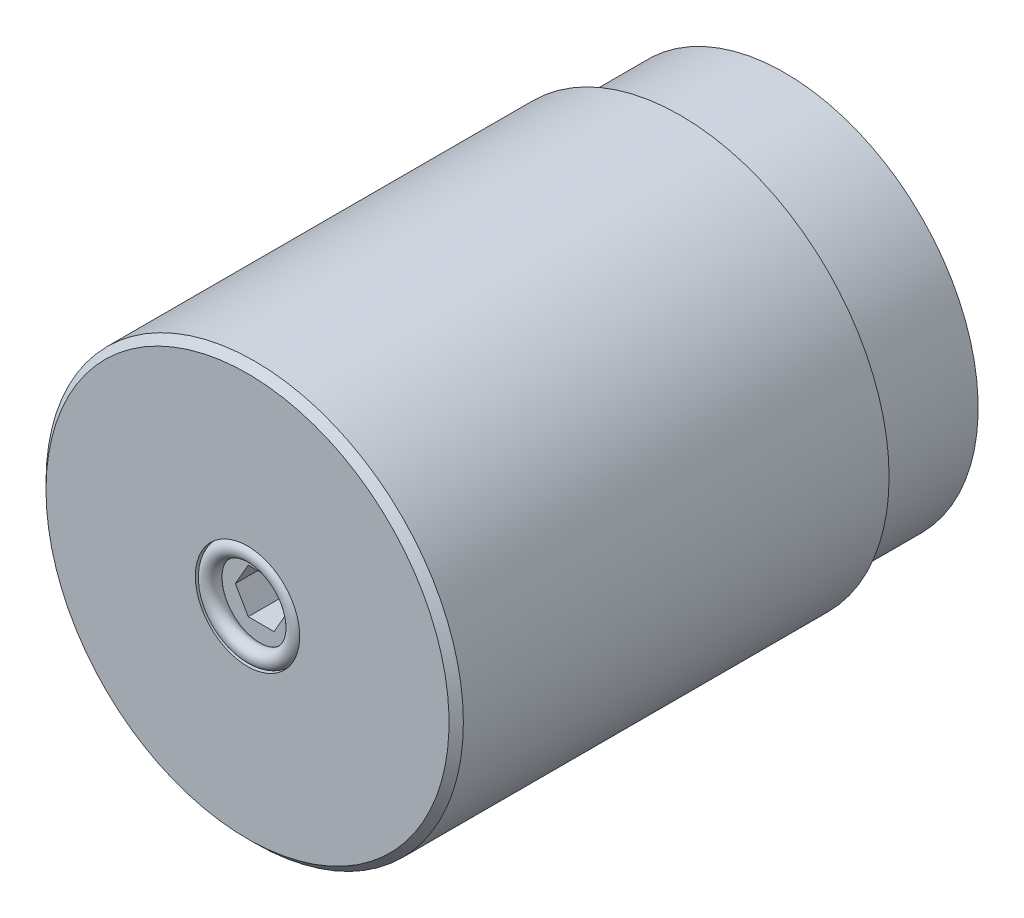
ISO-10303-21;
HEADER;
FILE_DESCRIPTION(('STEP AP214'),'2;1');
FILE_NAME('part.step','',(''),(''),'','','');
FILE_SCHEMA(('AUTOMOTIVE_DESIGN { 1 0 10303 214 1 1 1 1 }'));
ENDSEC;
DATA;
#1=APPLICATION_CONTEXT('core data for automotive mechanical design processes');
#2=APPLICATION_PROTOCOL_DEFINITION('international standard','automotive_design',2000,#1);
#3=PRODUCT_CONTEXT('',#1,'mechanical');
#4=PRODUCT('Part','Part','',(#3));
#5=PRODUCT_RELATED_PRODUCT_CATEGORY('part','',(#4));
#6=PRODUCT_DEFINITION_FORMATION('','',#4);
#7=PRODUCT_DEFINITION_CONTEXT('part definition',#1,'design');
#8=PRODUCT_DEFINITION('design','',#6,#7);
#9=PRODUCT_DEFINITION_SHAPE('','',#8);
#10=(LENGTH_UNIT() NAMED_UNIT(*) SI_UNIT(.MILLI.,.METRE.));
#11=(NAMED_UNIT(*) PLANE_ANGLE_UNIT() SI_UNIT($,.RADIAN.));
#12=(NAMED_UNIT(*) SI_UNIT($,.STERADIAN.) SOLID_ANGLE_UNIT());
#13=UNCERTAINTY_MEASURE_WITH_UNIT(LENGTH_MEASURE(1.E-05),#10,'distance_accuracy_value','');
#14=(GEOMETRIC_REPRESENTATION_CONTEXT(3) GLOBAL_UNCERTAINTY_ASSIGNED_CONTEXT((#13)) GLOBAL_UNIT_ASSIGNED_CONTEXT((#10,
#11,#12)) REPRESENTATION_CONTEXT('',''));
#15=CARTESIAN_POINT('',(0.,0.,0.));
#16=DIRECTION('',(0.,0.,1.));
#17=DIRECTION('',(1.,0.,0.));
#18=AXIS2_PLACEMENT_3D('',#15,#16,#17);
#19=CARTESIAN_POINT('',(0.,0.,-1.4478));
#20=DIRECTION('',(0.,0.,1.));
#21=DIRECTION('',(1.,0.,0.));
#22=AXIS2_PLACEMENT_3D('',#19,#20,#21);
#23=PLANE('',#22);
#24=CARTESIAN_POINT('',(0.,0.,-1.4478));
#25=DIRECTION('',(0.,0.,-1.));
#26=DIRECTION('',(-1.,0.,0.));
#27=AXIS2_PLACEMENT_3D('',#24,#25,#26);
#28=CIRCLE('',#27,5.5499);
#29=CARTESIAN_POINT('',(-5.5499,0.,-1.4478));
#30=VERTEX_POINT('',#29);
#31=EDGE_CURVE('E153',#30,#30,#28,.T.);
#32=ORIENTED_EDGE('',*,*,#31,.F.);
#33=EDGE_LOOP('',(#32));
#34=FACE_BOUND('',#33,.T.);
#35=CARTESIAN_POINT('',(0.,0.,-1.4478));
#36=DIRECTION('',(0.,0.,1.));
#37=DIRECTION('',(1.,0.,0.));
#38=AXIS2_PLACEMENT_3D('',#35,#36,#37);
#39=CIRCLE('',#38,5.11753501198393);
#40=CARTESIAN_POINT('',(5.11753501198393,0.,-1.4478));
#41=VERTEX_POINT('',#40);
#42=EDGE_CURVE('E215',#41,#41,#39,.T.);
#43=ORIENTED_EDGE('',*,*,#42,.F.);
#44=EDGE_LOOP('',(#43));
#45=FACE_BOUND('',#44,.T.);
#46=ADVANCED_FACE('F33',(#34,#45),#23,.T.);
#47=CARTESIAN_POINT('',(0.,0.,0.));
#48=DIRECTION('',(0.,0.,-1.));
#49=DIRECTION('',(-1.,0.,0.));
#50=AXIS2_PLACEMENT_3D('',#47,#48,#49);
#51=CYLINDRICAL_SURFACE('',#50,5.5499);
#52=ORIENTED_EDGE('',*,*,#31,.T.);
#53=EDGE_LOOP('',(#52));
#54=FACE_BOUND('',#53,.T.);
#55=CARTESIAN_POINT('',(0.,0.,0.));
#56=DIRECTION('',(0.,0.,-1.));
#57=DIRECTION('',(-1.,0.,0.));
#58=AXIS2_PLACEMENT_3D('',#55,#56,#57);
#59=CIRCLE('',#58,5.5499);
#60=CARTESIAN_POINT('',(-5.5499,0.,0.));
#61=VERTEX_POINT('',#60);
#62=EDGE_CURVE('E150',#61,#61,#59,.T.);
#63=ORIENTED_EDGE('',*,*,#62,.F.);
#64=EDGE_LOOP('',(#63));
#65=FACE_BOUND('',#64,.T.);
#66=ADVANCED_FACE('F184',(#54,#65),#51,.F.);
#67=CARTESIAN_POINT('',(0.,5.5499,0.));
#68=DIRECTION('',(0.,0.,1.));
#69=DIRECTION('',(1.,0.,0.));
#70=AXIS2_PLACEMENT_3D('',#67,#68,#69);
#71=PLANE('',#70);
#72=CARTESIAN_POINT('',(0.,0.,0.));
#73=DIRECTION('',(0.,0.,1.));
#74=DIRECTION('',(1.,0.,0.));
#75=AXIS2_PLACEMENT_3D('',#72,#73,#74);
#76=CIRCLE('',#75,21.4376);
#77=CARTESIAN_POINT('',(-21.4376,0.,0.));
#78=VERTEX_POINT('',#77);
#79=EDGE_CURVE('E165',#78,#78,#76,.T.);
#80=ORIENTED_EDGE('',*,*,#79,.T.);
#81=EDGE_LOOP('',(#80));
#82=FACE_BOUND('',#81,.T.);
#83=ORIENTED_EDGE('',*,*,#62,.T.);
#84=EDGE_LOOP('',(#83));
#85=FACE_BOUND('',#84,.T.);
#86=ADVANCED_FACE('F191',(#82,#85),#71,.T.);
#87=CARTESIAN_POINT('',(0.,0.,0.));
#88=DIRECTION('',(0.,0.,-1.));
#89=DIRECTION('',(-1.,0.,0.));
#90=AXIS2_PLACEMENT_3D('',#87,#88,#89);
#91=CYLINDRICAL_SURFACE('',#90,22.1996);
#92=CARTESIAN_POINT('',(0.,0.,-0.761999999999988));
#93=DIRECTION('',(0.,0.,1.));
#94=DIRECTION('',(1.,0.,0.));
#95=AXIS2_PLACEMENT_3D('',#92,#93,#94);
#96=CIRCLE('',#95,22.1996);
#97=CARTESIAN_POINT('',(-22.1996,0.,-0.761999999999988));
#98=VERTEX_POINT('',#97);
#99=EDGE_CURVE('E162',#98,#98,#96,.F.);
#100=ORIENTED_EDGE('',*,*,#99,.T.);
#101=EDGE_LOOP('',(#100));
#102=FACE_BOUND('',#101,.T.);
#103=CARTESIAN_POINT('',(0.,0.,-46.0502));
#104=DIRECTION('',(0.,0.,-1.));
#105=DIRECTION('',(-1.,0.,0.));
#106=AXIS2_PLACEMENT_3D('',#103,#104,#105);
#107=CIRCLE('',#106,22.1996);
#108=CARTESIAN_POINT('',(-22.1996,0.,-46.0502));
#109=VERTEX_POINT('',#108);
#110=EDGE_CURVE('E147',#109,#109,#107,.T.);
#111=ORIENTED_EDGE('',*,*,#110,.F.);
#112=EDGE_LOOP('',(#111));
#113=FACE_BOUND('',#112,.T.);
#114=ADVANCED_FACE('F254',(#102,#113),#91,.T.);
#115=CARTESIAN_POINT('',(0.,22.1996,-46.0502));
#116=DIRECTION('',(0.,0.,-1.));
#117=DIRECTION('',(-1.,0.,0.));
#118=AXIS2_PLACEMENT_3D('',#115,#116,#117);
#119=PLANE('',#118);
#120=CARTESIAN_POINT('',(0.,0.,-46.0502));
#121=DIRECTION('',(0.,0.,-1.));
#122=DIRECTION('',(-1.,0.,0.));
#123=AXIS2_PLACEMENT_3D('',#120,#121,#122);
#124=CIRCLE('',#123,20.955);
#125=CARTESIAN_POINT('',(-20.955,0.,-46.0502));
#126=VERTEX_POINT('',#125);
#127=EDGE_CURVE('E159',#126,#126,#124,.F.);
#128=ORIENTED_EDGE('',*,*,#127,.T.);
#129=EDGE_LOOP('',(#128));
#130=FACE_BOUND('',#129,.T.);
#131=ORIENTED_EDGE('',*,*,#110,.T.);
#132=EDGE_LOOP('',(#131));
#133=FACE_BOUND('',#132,.T.);
#134=ADVANCED_FACE('F250',(#130,#133),#119,.T.);
#135=CARTESIAN_POINT('',(0.,0.,0.));
#136=DIRECTION('',(0.,0.,-1.));
#137=DIRECTION('',(-1.,0.,0.));
#138=AXIS2_PLACEMENT_3D('',#135,#136,#137);
#139=CYLINDRICAL_SURFACE('',#138,20.574);
#140=CARTESIAN_POINT('',(0.,0.,-46.4312));
#141=DIRECTION('',(0.,0.,-1.));
#142=DIRECTION('',(-1.,0.,0.));
#143=AXIS2_PLACEMENT_3D('',#140,#141,#142);
#144=CIRCLE('',#143,20.574);
#145=CARTESIAN_POINT('',(-20.574,0.,-46.4312));
#146=VERTEX_POINT('',#145);
#147=EDGE_CURVE('E156',#146,#146,#144,.T.);
#148=ORIENTED_EDGE('',*,*,#147,.T.);
#149=EDGE_LOOP('',(#148));
#150=FACE_BOUND('',#149,.T.);
#151=CARTESIAN_POINT('',(0.,0.,-57.15));
#152=DIRECTION('',(0.,0.,-1.));
#153=DIRECTION('',(-1.,0.,0.));
#154=AXIS2_PLACEMENT_3D('',#151,#152,#153);
#155=CIRCLE('',#154,20.574);
#156=CARTESIAN_POINT('',(-20.574,0.,-57.15));
#157=VERTEX_POINT('',#156);
#158=EDGE_CURVE('E139',#157,#157,#155,.T.);
#159=ORIENTED_EDGE('',*,*,#158,.F.);
#160=EDGE_LOOP('',(#159));
#161=FACE_BOUND('',#160,.T.);
#162=ADVANCED_FACE('F246',(#150,#161),#139,.T.);
#163=CARTESIAN_POINT('',(0.,20.574,-57.15));
#164=DIRECTION('',(0.,0.,-1.));
#165=DIRECTION('',(-1.,0.,0.));
#166=AXIS2_PLACEMENT_3D('',#163,#164,#165);
#167=PLANE('',#166);
#168=CARTESIAN_POINT('',(0.,4.445,-57.15));
#169=DIRECTION('',(0.,0.,-1.));
#170=DIRECTION('',(-1.,0.,0.));
#171=AXIS2_PLACEMENT_3D('',#168,#169,#170);
#172=CIRCLE('',#171,9.8552);
#173=CARTESIAN_POINT('',(-9.8552,4.445,-57.15));
#174=VERTEX_POINT('',#173);
#175=EDGE_CURVE('E11',#174,#174,#172,.F.);
#176=ORIENTED_EDGE('',*,*,#175,.T.);
#177=EDGE_LOOP('',(#176));
#178=FACE_BOUND('',#177,.T.);
#179=CARTESIAN_POINT('',(-15.875,1.12806160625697E-13,-57.15));
#180=DIRECTION('',(0.,0.,-1.));
#181=DIRECTION('',(-1.,0.,0.));
#182=AXIS2_PLACEMENT_3D('',#179,#180,#181);
#183=CIRCLE('',#182,1.5875);
#184=CARTESIAN_POINT('',(-17.4625,1.12806160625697E-13,-57.15));
#185=VERTEX_POINT('',#184);
#186=EDGE_CURVE('E493',#185,#185,#183,.T.);
#187=ORIENTED_EDGE('',*,*,#186,.F.);
#188=EDGE_LOOP('',(#187));
#189=FACE_BOUND('',#188,.T.);
#190=CARTESIAN_POINT('',(-7.93750000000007,-13.7481532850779,-57.15));
#191=DIRECTION('',(0.,0.,-1.));
#192=DIRECTION('',(-1.,0.,0.));
#193=AXIS2_PLACEMENT_3D('',#190,#191,#192);
#194=CIRCLE('',#193,1.5875);
#195=CARTESIAN_POINT('',(-9.52500000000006,-13.7481532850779,-57.15));
#196=VERTEX_POINT('',#195);
#197=EDGE_CURVE('E502',#196,#196,#194,.T.);
#198=ORIENTED_EDGE('',*,*,#197,.F.);
#199=EDGE_LOOP('',(#198));
#200=FACE_BOUND('',#199,.T.);
#201=CARTESIAN_POINT('',(7.93749999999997,-13.748153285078,-57.15));
#202=DIRECTION('',(0.,0.,-1.));
#203=DIRECTION('',(-1.,0.,0.));
#204=AXIS2_PLACEMENT_3D('',#201,#202,#203);
#205=CIRCLE('',#204,1.5875);
#206=CARTESIAN_POINT('',(6.34999999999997,-13.748153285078,-57.15));
#207=VERTEX_POINT('',#206);
#208=EDGE_CURVE('E508',#207,#207,#205,.T.);
#209=ORIENTED_EDGE('',*,*,#208,.F.);
#210=EDGE_LOOP('',(#209));
#211=FACE_BOUND('',#210,.T.);
#212=CARTESIAN_POINT('',(15.875,0.,-57.15));
#213=DIRECTION('',(0.,0.,-1.));
#214=DIRECTION('',(-1.,0.,0.));
#215=AXIS2_PLACEMENT_3D('',#212,#213,#214);
#216=CIRCLE('',#215,1.5875);
#217=CARTESIAN_POINT('',(14.2875,0.,-57.15));
#218=VERTEX_POINT('',#217);
#219=EDGE_CURVE('E218',#218,#218,#216,.T.);
#220=ORIENTED_EDGE('',*,*,#219,.F.);
#221=EDGE_LOOP('',(#220));
#222=FACE_BOUND('',#221,.T.);
#223=ORIENTED_EDGE('',*,*,#158,.T.);
#224=EDGE_LOOP('',(#223));
#225=FACE_BOUND('',#224,.T.);
#226=ADVANCED_FACE('F242',(#178,#189,#200,#211,#222,#225),#167,.T.);
#227=CARTESIAN_POINT('',(0.,0.,-46.4312));
#228=DIRECTION('',(0.,0.,-1.));
#229=DIRECTION('',(-1.,0.,0.));
#230=AXIS2_PLACEMENT_3D('',#227,#228,#229);
#231=TOROIDAL_SURFACE('',#230,20.955,0.381);
#232=ORIENTED_EDGE('',*,*,#127,.F.);
#233=EDGE_LOOP('',(#232));
#234=FACE_BOUND('',#233,.T.);
#235=ORIENTED_EDGE('',*,*,#147,.F.);
#236=EDGE_LOOP('',(#235));
#237=FACE_BOUND('',#236,.T.);
#238=ADVANCED_FACE('F245',(#234,#237),#231,.F.);
#239=CARTESIAN_POINT('',(0.,0.,-0.6858));
#240=DIRECTION('',(0.,0.,1.));
#241=DIRECTION('',(1.,0.,0.));
#242=AXIS2_PLACEMENT_3D('',#239,#240,#241);
#243=TOROIDAL_SURFACE('',#242,4.65963,0.889);
#244=CARTESIAN_POINT('',(0.,0.,-1.4478));
#245=DIRECTION('',(0.,0.,1.));
#246=DIRECTION('',(1.,0.,0.));
#247=AXIS2_PLACEMENT_3D('',#244,#245,#246);
#248=CIRCLE('',#247,4.20172498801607);
#249=CARTESIAN_POINT('',(4.20172498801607,0.,-1.4478));
#250=VERTEX_POINT('',#249);
#251=EDGE_CURVE('E126',#250,#250,#248,.T.);
#252=ORIENTED_EDGE('',*,*,#251,.F.);
#253=EDGE_LOOP('',(#252));
#254=FACE_BOUND('',#253,.T.);
#255=ORIENTED_EDGE('',*,*,#42,.T.);
#256=EDGE_LOOP('',(#255));
#257=FACE_BOUND('',#256,.T.);
#258=ADVANCED_FACE('F299',(#254,#257),#243,.T.);
#259=CARTESIAN_POINT('',(4.11344746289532,2.3749,-8.382));
#260=DIRECTION('',(0.,0.,1.));
#261=DIRECTION('',(1.,0.,0.));
#262=AXIS2_PLACEMENT_3D('',#259,#260,#261);
#263=PLANE('',#262);
#264=DIRECTION('',(0.5,0.866025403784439,0.));
#265=VECTOR('',#264,1.);
#266=CARTESIAN_POINT('',(1.37114915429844,-2.3749,-8.382));
#267=LINE('',#266,#265);
#268=CARTESIAN_POINT('',(1.37114915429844,-2.3749,-8.382));
#269=VERTEX_POINT('',#268);
#270=CARTESIAN_POINT('',(2.74229830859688,0.,-8.382));
#271=VERTEX_POINT('',#270);
#272=EDGE_CURVE('E137',#269,#271,#267,.T.);
#273=ORIENTED_EDGE('',*,*,#272,.T.);
#274=DIRECTION('',(-0.5,0.866025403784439,0.));
#275=VECTOR('',#274,1.);
#276=CARTESIAN_POINT('',(2.74229830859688,0.,-8.382));
#277=LINE('',#276,#275);
#278=CARTESIAN_POINT('',(1.37114915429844,2.3749,-8.382));
#279=VERTEX_POINT('',#278);
#280=EDGE_CURVE('E119',#271,#279,#277,.T.);
#281=ORIENTED_EDGE('',*,*,#280,.T.);
#282=DIRECTION('',(-1.,0.,0.));
#283=VECTOR('',#282,1.);
#284=CARTESIAN_POINT('',(1.37114915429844,2.3749,-8.382));
#285=LINE('',#284,#283);
#286=CARTESIAN_POINT('',(-1.37114915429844,2.3749,-8.382));
#287=VERTEX_POINT('',#286);
#288=EDGE_CURVE('E117',#279,#287,#285,.T.);
#289=ORIENTED_EDGE('',*,*,#288,.T.);
#290=DIRECTION('',(-0.5,-0.866025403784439,0.));
#291=VECTOR('',#290,1.);
#292=CARTESIAN_POINT('',(-1.37114915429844,2.3749,-8.382));
#293=LINE('',#292,#291);
#294=CARTESIAN_POINT('',(-2.74229830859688,0.,-8.382));
#295=VERTEX_POINT('',#294);
#296=EDGE_CURVE('E96',#287,#295,#293,.T.);
#297=ORIENTED_EDGE('',*,*,#296,.T.);
#298=DIRECTION('',(0.5,-0.866025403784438,0.));
#299=VECTOR('',#298,1.);
#300=CARTESIAN_POINT('',(-2.74229830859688,0.,-8.382));
#301=LINE('',#300,#299);
#302=CARTESIAN_POINT('',(-1.37114915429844,-2.3749,-8.382));
#303=VERTEX_POINT('',#302);
#304=EDGE_CURVE('E107',#295,#303,#301,.T.);
#305=ORIENTED_EDGE('',*,*,#304,.T.);
#306=DIRECTION('',(1.,0.,0.));
#307=VECTOR('',#306,1.);
#308=CARTESIAN_POINT('',(-1.37114915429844,-2.3749,-8.382));
#309=LINE('',#308,#307);
#310=EDGE_CURVE('E111',#303,#269,#309,.T.);
#311=ORIENTED_EDGE('',*,*,#310,.T.);
#312=EDGE_LOOP('',(#273,#281,#289,#297,#305,#311));
#313=FACE_BOUND('',#312,.T.);
#314=ADVANCED_FACE('F114',(#313),#263,.T.);
#315=CARTESIAN_POINT('',(2.74229830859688,0.,-8.382));
#316=DIRECTION('',(0.866025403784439,0.5,0.));
#317=DIRECTION('',(-0.5,0.866025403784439,0.));
#318=AXIS2_PLACEMENT_3D('',#315,#316,#317);
#319=PLANE('',#318);
#320=DIRECTION('',(-0.5,0.866025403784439,0.));
#321=VECTOR('',#320,1.);
#322=CARTESIAN_POINT('',(2.74229830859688,0.,-1.4478));
#323=LINE('',#322,#321);
#324=CARTESIAN_POINT('',(2.74229830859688,0.,-1.4478));
#325=VERTEX_POINT('',#324);
#326=CARTESIAN_POINT('',(1.37114915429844,2.3749,-1.4478));
#327=VERTEX_POINT('',#326);
#328=EDGE_CURVE('E125',#325,#327,#323,.T.);
#329=ORIENTED_EDGE('',*,*,#328,.T.);
#330=DIRECTION('',(0.,0.,1.));
#331=VECTOR('',#330,1.);
#332=CARTESIAN_POINT('',(1.37114915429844,2.3749,-8.382));
#333=LINE('',#332,#331);
#334=EDGE_CURVE('E142',#279,#327,#333,.T.);
#335=ORIENTED_EDGE('',*,*,#334,.F.);
#336=ORIENTED_EDGE('',*,*,#280,.F.);
#337=DIRECTION('',(0.,0.,1.));
#338=VECTOR('',#337,1.);
#339=CARTESIAN_POINT('',(2.74229830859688,0.,-8.382));
#340=LINE('',#339,#338);
#341=EDGE_CURVE('E79',#271,#325,#340,.T.);
#342=ORIENTED_EDGE('',*,*,#341,.T.);
#343=EDGE_LOOP('',(#329,#335,#336,#342));
#344=FACE_BOUND('',#343,.T.);
#345=ADVANCED_FACE('F223',(#344),#319,.F.);
#346=CARTESIAN_POINT('',(1.37114915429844,2.3749,-8.382));
#347=DIRECTION('',(0.,1.,0.));
#348=DIRECTION('',(-1.,0.,0.));
#349=AXIS2_PLACEMENT_3D('',#346,#347,#348);
#350=PLANE('',#349);
#351=DIRECTION('',(-1.,0.,0.));
#352=VECTOR('',#351,1.);
#353=CARTESIAN_POINT('',(1.37114915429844,2.3749,-1.4478));
#354=LINE('',#353,#352);
#355=CARTESIAN_POINT('',(-1.37114915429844,2.3749,-1.4478));
#356=VERTEX_POINT('',#355);
#357=EDGE_CURVE('E129',#327,#356,#354,.T.);
#358=ORIENTED_EDGE('',*,*,#357,.T.);
#359=DIRECTION('',(0.,0.,1.));
#360=VECTOR('',#359,1.);
#361=CARTESIAN_POINT('',(-1.37114915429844,2.3749,-8.382));
#362=LINE('',#361,#360);
#363=EDGE_CURVE('E104',#287,#356,#362,.T.);
#364=ORIENTED_EDGE('',*,*,#363,.F.);
#365=ORIENTED_EDGE('',*,*,#288,.F.);
#366=ORIENTED_EDGE('',*,*,#334,.T.);
#367=EDGE_LOOP('',(#358,#364,#365,#366));
#368=FACE_BOUND('',#367,.T.);
#369=ADVANCED_FACE('F226',(#368),#350,.F.);
#370=CARTESIAN_POINT('',(-1.37114915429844,2.3749,-8.382));
#371=DIRECTION('',(-0.866025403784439,0.5,0.));
#372=DIRECTION('',(-0.5,-0.866025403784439,0.));
#373=AXIS2_PLACEMENT_3D('',#370,#371,#372);
#374=PLANE('',#373);
#375=DIRECTION('',(-0.5,-0.866025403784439,0.));
#376=VECTOR('',#375,1.);
#377=CARTESIAN_POINT('',(-1.37114915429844,2.3749,-1.4478));
#378=LINE('',#377,#376);
#379=CARTESIAN_POINT('',(-2.74229830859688,0.,-1.4478));
#380=VERTEX_POINT('',#379);
#381=EDGE_CURVE('E99',#356,#380,#378,.T.);
#382=ORIENTED_EDGE('',*,*,#381,.T.);
#383=DIRECTION('',(0.,0.,1.));
#384=VECTOR('',#383,1.);
#385=CARTESIAN_POINT('',(-2.74229830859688,0.,-8.382));
#386=LINE('',#385,#384);
#387=EDGE_CURVE('E92',#295,#380,#386,.T.);
#388=ORIENTED_EDGE('',*,*,#387,.F.);
#389=ORIENTED_EDGE('',*,*,#296,.F.);
#390=ORIENTED_EDGE('',*,*,#363,.T.);
#391=EDGE_LOOP('',(#382,#388,#389,#390));
#392=FACE_BOUND('',#391,.T.);
#393=ADVANCED_FACE('F94',(#392),#374,.F.);
#394=CARTESIAN_POINT('',(-2.74229830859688,0.,-8.382));
#395=DIRECTION('',(-0.866025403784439,-0.5,0.));
#396=DIRECTION('',(0.5,-0.866025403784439,0.));
#397=AXIS2_PLACEMENT_3D('',#394,#395,#396);
#398=PLANE('',#397);
#399=DIRECTION('',(0.5,-0.866025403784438,0.));
#400=VECTOR('',#399,1.);
#401=CARTESIAN_POINT('',(-2.74229830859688,0.,-1.4478));
#402=LINE('',#401,#400);
#403=CARTESIAN_POINT('',(-1.37114915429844,-2.3749,-1.4478));
#404=VERTEX_POINT('',#403);
#405=EDGE_CURVE('E133',#380,#404,#402,.T.);
#406=ORIENTED_EDGE('',*,*,#405,.T.);
#407=DIRECTION('',(0.,0.,1.));
#408=VECTOR('',#407,1.);
#409=CARTESIAN_POINT('',(-1.37114915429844,-2.3749,-8.382));
#410=LINE('',#409,#408);
#411=EDGE_CURVE('E103',#303,#404,#410,.T.);
#412=ORIENTED_EDGE('',*,*,#411,.F.);
#413=ORIENTED_EDGE('',*,*,#304,.F.);
#414=ORIENTED_EDGE('',*,*,#387,.T.);
#415=EDGE_LOOP('',(#406,#412,#413,#414));
#416=FACE_BOUND('',#415,.T.);
#417=ADVANCED_FACE('F108',(#416),#398,.F.);
#418=CARTESIAN_POINT('',(-1.37114915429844,-2.3749,-8.382));
#419=DIRECTION('',(0.,-1.,0.));
#420=DIRECTION('',(0.,0.,-1.));
#421=AXIS2_PLACEMENT_3D('',#418,#419,#420);
#422=PLANE('',#421);
#423=DIRECTION('',(1.,0.,0.));
#424=VECTOR('',#423,1.);
#425=CARTESIAN_POINT('',(-1.37114915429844,-2.3749,-1.4478));
#426=LINE('',#425,#424);
#427=CARTESIAN_POINT('',(1.37114915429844,-2.3749,-1.4478));
#428=VERTEX_POINT('',#427);
#429=EDGE_CURVE('E135',#404,#428,#426,.T.);
#430=ORIENTED_EDGE('',*,*,#429,.T.);
#431=DIRECTION('',(0.,0.,1.));
#432=VECTOR('',#431,1.);
#433=CARTESIAN_POINT('',(1.37114915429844,-2.3749,-8.382));
#434=LINE('',#433,#432);
#435=EDGE_CURVE('E56',#269,#428,#434,.T.);
#436=ORIENTED_EDGE('',*,*,#435,.F.);
#437=ORIENTED_EDGE('',*,*,#310,.F.);
#438=ORIENTED_EDGE('',*,*,#411,.T.);
#439=EDGE_LOOP('',(#430,#436,#437,#438));
#440=FACE_BOUND('',#439,.T.);
#441=ADVANCED_FACE('F207',(#440),#422,.F.);
#442=CARTESIAN_POINT('',(1.37114915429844,-2.3749,-8.382));
#443=DIRECTION('',(0.866025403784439,-0.5,0.));
#444=DIRECTION('',(0.5,0.866025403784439,0.));
#445=AXIS2_PLACEMENT_3D('',#442,#443,#444);
#446=PLANE('',#445);
#447=DIRECTION('',(0.5,0.866025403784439,0.));
#448=VECTOR('',#447,1.);
#449=CARTESIAN_POINT('',(1.37114915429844,-2.3749,-1.4478));
#450=LINE('',#449,#448);
#451=EDGE_CURVE('E48',#428,#325,#450,.T.);
#452=ORIENTED_EDGE('',*,*,#451,.T.);
#453=ORIENTED_EDGE('',*,*,#341,.F.);
#454=ORIENTED_EDGE('',*,*,#272,.F.);
#455=ORIENTED_EDGE('',*,*,#435,.T.);
#456=EDGE_LOOP('',(#452,#453,#454,#455));
#457=FACE_BOUND('',#456,.T.);
#458=ADVANCED_FACE('F199',(#457),#446,.F.);
#459=ORIENTED_EDGE('',*,*,#451,.F.);
#460=ORIENTED_EDGE('',*,*,#429,.F.);
#461=ORIENTED_EDGE('',*,*,#405,.F.);
#462=ORIENTED_EDGE('',*,*,#381,.F.);
#463=ORIENTED_EDGE('',*,*,#357,.F.);
#464=ORIENTED_EDGE('',*,*,#328,.F.);
#465=EDGE_LOOP('',(#459,#460,#461,#462,#463,#464));
#466=FACE_BOUND('',#465,.T.);
#467=ORIENTED_EDGE('',*,*,#251,.T.);
#468=EDGE_LOOP('',(#467));
#469=FACE_BOUND('',#468,.T.);
#470=ADVANCED_FACE('F187',(#466,#469),#23,.T.);
#471=CARTESIAN_POINT('',(0.,0.,-0.761999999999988));
#472=DIRECTION('',(0.,0.,-1.));
#473=DIRECTION('',(-1.,0.,0.));
#474=AXIS2_PLACEMENT_3D('',#471,#472,#473);
#475=CONICAL_SURFACE('',#474,22.1996,0.785398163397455);
#476=CARTESIAN_POINT('',(-21.4376,0.,0.));
#477=CARTESIAN_POINT('',(-21.4455375,0.,-0.00793749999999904));
#478=CARTESIAN_POINT('',(-21.453475,0.,-0.0158749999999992));
#479=CARTESIAN_POINT('',(-21.46935,0.,-0.0317499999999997));
#480=CARTESIAN_POINT('',(-21.4772875,0.,-0.0396874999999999));
#481=CARTESIAN_POINT('',(-21.4931625,0.,-0.0555624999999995));
#482=CARTESIAN_POINT('',(-21.5011,0.,-0.0634999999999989));
#483=CARTESIAN_POINT('',(-21.516975,0.,-0.0793749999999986));
#484=CARTESIAN_POINT('',(-21.5249125,0.,-0.0873124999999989));
#485=CARTESIAN_POINT('',(-21.5407875,0.,-0.103187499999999));
#486=CARTESIAN_POINT('',(-21.548725,0.,-0.111124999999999));
#487=CARTESIAN_POINT('',(-21.5646,0.,-0.126999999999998));
#488=CARTESIAN_POINT('',(-21.5725375,0.,-0.134937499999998));
#489=CARTESIAN_POINT('',(-21.5884125,0.,-0.150812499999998));
#490=CARTESIAN_POINT('',(-21.59635,0.,-0.158749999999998));
#491=CARTESIAN_POINT('',(-21.612225,0.,-0.174624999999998));
#492=CARTESIAN_POINT('',(-21.6201625,0.,-0.182562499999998));
#493=CARTESIAN_POINT('',(-21.6360375,0.,-0.198437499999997));
#494=CARTESIAN_POINT('',(-21.643975,0.,-0.206374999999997));
#495=CARTESIAN_POINT('',(-21.65985,0.,-0.222249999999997));
#496=CARTESIAN_POINT('',(-21.6677875,0.,-0.230187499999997));
#497=CARTESIAN_POINT('',(-21.6836625,0.,-0.246062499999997));
#498=CARTESIAN_POINT('',(-21.6916,0.,-0.253999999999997));
#499=CARTESIAN_POINT('',(-21.707475,0.,-0.269874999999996));
#500=CARTESIAN_POINT('',(-21.7154125,0.,-0.277812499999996));
#501=CARTESIAN_POINT('',(-21.7312875,0.,-0.293687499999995));
#502=CARTESIAN_POINT('',(-21.739225,0.,-0.301624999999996));
#503=CARTESIAN_POINT('',(-21.7551,0.,-0.317499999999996));
#504=CARTESIAN_POINT('',(-21.7630375,0.,-0.325437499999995));
#505=CARTESIAN_POINT('',(-21.7789125,0.,-0.341312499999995));
#506=CARTESIAN_POINT('',(-21.78685,0.,-0.349249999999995));
#507=CARTESIAN_POINT('',(-21.802725,0.,-0.365124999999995));
#508=CARTESIAN_POINT('',(-21.8106625,0.,-0.373062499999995));
#509=CARTESIAN_POINT('',(-21.8265375,0.,-0.388937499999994));
#510=CARTESIAN_POINT('',(-21.834475,0.,-0.396874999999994));
#511=CARTESIAN_POINT('',(-21.85035,0.,-0.412749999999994));
#512=CARTESIAN_POINT('',(-21.8582875,0.,-0.420687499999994));
#513=CARTESIAN_POINT('',(-21.8741625,0.,-0.436562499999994));
#514=CARTESIAN_POINT('',(-21.8821,0.,-0.444499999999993));
#515=CARTESIAN_POINT('',(-21.897975,0.,-0.460374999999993));
#516=CARTESIAN_POINT('',(-21.9059125,0.,-0.468312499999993));
#517=CARTESIAN_POINT('',(-21.9217875,0.,-0.484187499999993));
#518=CARTESIAN_POINT('',(-21.929725,0.,-0.492124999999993));
#519=CARTESIAN_POINT('',(-21.9456,0.,-0.507999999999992));
#520=CARTESIAN_POINT('',(-21.9535375,0.,-0.515937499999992));
#521=CARTESIAN_POINT('',(-21.9694125,0.,-0.531812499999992));
#522=CARTESIAN_POINT('',(-21.97735,0.,-0.539749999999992));
#523=CARTESIAN_POINT('',(-21.993225,0.,-0.555624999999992));
#524=CARTESIAN_POINT('',(-22.0011625,0.,-0.563562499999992));
#525=CARTESIAN_POINT('',(-22.0170375,0.,-0.579437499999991));
#526=CARTESIAN_POINT('',(-22.024975,0.,-0.587374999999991));
#527=CARTESIAN_POINT('',(-22.04085,0.,-0.603249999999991));
#528=CARTESIAN_POINT('',(-22.0487875,0.,-0.611187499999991));
#529=CARTESIAN_POINT('',(-22.0646625,0.,-0.627062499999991));
#530=CARTESIAN_POINT('',(-22.0726,0.,-0.634999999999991));
#531=CARTESIAN_POINT('',(-22.088475,0.,-0.65087499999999));
#532=CARTESIAN_POINT('',(-22.0964125,0.,-0.65881249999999));
#533=CARTESIAN_POINT('',(-22.1122875,0.,-0.67468749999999));
#534=CARTESIAN_POINT('',(-22.120225,0.,-0.68262499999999));
#535=CARTESIAN_POINT('',(-22.1361,0.,-0.69849999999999));
#536=CARTESIAN_POINT('',(-22.1440375,0.,-0.706437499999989));
#537=CARTESIAN_POINT('',(-22.1599125,0.,-0.722312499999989));
#538=CARTESIAN_POINT('',(-22.16785,0.,-0.730249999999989));
#539=CARTESIAN_POINT('',(-22.183725,0.,-0.746124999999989));
#540=CARTESIAN_POINT('',(-22.1916625,0.,-0.75406249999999));
#541=CARTESIAN_POINT('',(-22.1996,0.,-0.761999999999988));
#542=B_SPLINE_CURVE_WITH_KNOTS('',3,(#476,#477,#478,#479,#480,#481,#482,#483,#484,#485,#486,
#487,#488,#489,#490,#491,#492,#493,#494,#495,#496,#497,#498,#499,#500,#501,#502,#503,#504,#505,
#506,#507,#508,#509,#510,#511,#512,#513,#514,#515,#516,#517,#518,#519,#520,#521,#522,#523,#524,
#525,#526,#527,#528,#529,#530,#531,#532,#533,#534,#535,#536,#537,#538,#539,#540,#541),
.UNSPECIFIED.,.F.,.F.,(4,2,2,2,2,2,2,2,2,2,2,2,2,2,2,2,2,2,2,2,2,2,2,2,2,2,2,2,2,2,2,2,4),(0.,
0.03367596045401,0.0673519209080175,0.101027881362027,0.134703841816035,0.168379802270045,
0.202055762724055,0.235731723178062,0.269407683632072,0.303083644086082,0.33675960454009,
0.3704355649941,0.40411152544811,0.437787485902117,0.471463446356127,0.505139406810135,
0.538815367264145,0.572491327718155,0.606167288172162,0.639843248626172,0.67351920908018,
0.70719516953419,0.7408711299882,0.774547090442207,0.808223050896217,0.841899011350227,
0.875574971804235,0.909250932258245,0.942926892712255,0.976602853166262,1.01027881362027,
1.04395477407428,1.07763073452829),.UNSPECIFIED.);
#543=EDGE_CURVE('BSEAM198',#78,#98,#542,.T.);
#544=ORIENTED_EDGE('',*,*,#79,.F.);
#545=ORIENTED_EDGE('',*,*,#99,.F.);
#546=ORIENTED_EDGE('',*,*,#543,.T.);
#547=ORIENTED_EDGE('',*,*,#543,.F.);
#548=EDGE_LOOP('',(#544,#546,#545,#547));
#549=FACE_BOUND('',#548,.T.);
#550=ADVANCED_FACE('F198',(#549),#475,.T.);
#551=CARTESIAN_POINT('',(15.875,0.,-57.15));
#552=DIRECTION('',(0.,0.,-1.));
#553=DIRECTION('',(-1.,0.,0.));
#554=AXIS2_PLACEMENT_3D('',#551,#552,#553);
#555=CYLINDRICAL_SURFACE('',#554,1.5875);
#556=CARTESIAN_POINT('',(15.875,0.,-53.848));
#557=DIRECTION('',(0.,0.,-1.));
#558=DIRECTION('',(-1.,0.,0.));
#559=AXIS2_PLACEMENT_3D('',#556,#557,#558);
#560=CIRCLE('',#559,1.5875);
#561=CARTESIAN_POINT('',(14.2875,0.,-53.848));
#562=VERTEX_POINT('',#561);
#563=EDGE_CURVE('E511',#562,#562,#560,.T.);
#564=ORIENTED_EDGE('',*,*,#563,.F.);
#565=EDGE_LOOP('',(#564));
#566=FACE_BOUND('',#565,.T.);
#567=ORIENTED_EDGE('',*,*,#219,.T.);
#568=EDGE_LOOP('',(#567));
#569=FACE_BOUND('',#568,.T.);
#570=ADVANCED_FACE('F205',(#566,#569),#555,.F.);
#571=CARTESIAN_POINT('',(15.875,0.,-53.848));
#572=DIRECTION('',(0.,0.,-1.));
#573=DIRECTION('',(-1.,0.,0.));
#574=AXIS2_PLACEMENT_3D('',#571,#572,#573);
#575=CONICAL_SURFACE('',#574,1.5875,1.02974425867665);
#576=CARTESIAN_POINT('',(15.875,0.,-52.8941337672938));
#577=VERTEX_POINT('',#576);
#578=VERTEX_LOOP('',#577);
#579=FACE_BOUND('',#578,.T.);
#580=ORIENTED_EDGE('',*,*,#563,.T.);
#581=EDGE_LOOP('',(#580));
#582=FACE_BOUND('',#581,.T.);
#583=ADVANCED_FACE('F384',(#579,#582),#575,.F.);
#584=CARTESIAN_POINT('',(7.93749999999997,-13.748153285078,-57.15));
#585=DIRECTION('',(0.,0.,-1.));
#586=DIRECTION('',(-1.,0.,0.));
#587=AXIS2_PLACEMENT_3D('',#584,#585,#586);
#588=CYLINDRICAL_SURFACE('',#587,1.5875);
#589=CARTESIAN_POINT('',(7.93749999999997,-13.748153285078,-53.848));
#590=DIRECTION('',(0.,0.,-1.));
#591=DIRECTION('',(-1.,0.,0.));
#592=AXIS2_PLACEMENT_3D('',#589,#590,#591);
#593=CIRCLE('',#592,1.5875);
#594=CARTESIAN_POINT('',(6.34999999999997,-13.748153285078,-53.848));
#595=VERTEX_POINT('',#594);
#596=EDGE_CURVE('E505',#595,#595,#593,.T.);
#597=ORIENTED_EDGE('',*,*,#596,.F.);
#598=EDGE_LOOP('',(#597));
#599=FACE_BOUND('',#598,.T.);
#600=ORIENTED_EDGE('',*,*,#208,.T.);
#601=EDGE_LOOP('',(#600));
#602=FACE_BOUND('',#601,.T.);
#603=ADVANCED_FACE('F393',(#599,#602),#588,.F.);
#604=CARTESIAN_POINT('',(7.93749999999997,-13.748153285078,-53.848));
#605=DIRECTION('',(0.,0.,-1.));
#606=DIRECTION('',(-1.,0.,0.));
#607=AXIS2_PLACEMENT_3D('',#604,#605,#606);
#608=CONICAL_SURFACE('',#607,1.5875,1.02974425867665);
#609=CARTESIAN_POINT('',(7.93749999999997,-13.748153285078,-52.8941337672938));
#610=VERTEX_POINT('',#609);
#611=VERTEX_LOOP('',#610);
#612=FACE_BOUND('',#611,.T.);
#613=ORIENTED_EDGE('',*,*,#596,.T.);
#614=EDGE_LOOP('',(#613));
#615=FACE_BOUND('',#614,.T.);
#616=ADVANCED_FACE('F402',(#612,#615),#608,.F.);
#617=CARTESIAN_POINT('',(-7.93750000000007,-13.7481532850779,-57.15));
#618=DIRECTION('',(0.,0.,-1.));
#619=DIRECTION('',(-1.,0.,0.));
#620=AXIS2_PLACEMENT_3D('',#617,#618,#619);
#621=CYLINDRICAL_SURFACE('',#620,1.5875);
#622=CARTESIAN_POINT('',(-7.93750000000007,-13.7481532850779,-53.848));
#623=DIRECTION('',(0.,0.,-1.));
#624=DIRECTION('',(-1.,0.,0.));
#625=AXIS2_PLACEMENT_3D('',#622,#623,#624);
#626=CIRCLE('',#625,1.5875);
#627=CARTESIAN_POINT('',(-9.52500000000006,-13.7481532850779,-53.848));
#628=VERTEX_POINT('',#627);
#629=EDGE_CURVE('E499',#628,#628,#626,.T.);
#630=ORIENTED_EDGE('',*,*,#629,.F.);
#631=EDGE_LOOP('',(#630));
#632=FACE_BOUND('',#631,.T.);
#633=ORIENTED_EDGE('',*,*,#197,.T.);
#634=EDGE_LOOP('',(#633));
#635=FACE_BOUND('',#634,.T.);
#636=ADVANCED_FACE('F411',(#632,#635),#621,.F.);
#637=CARTESIAN_POINT('',(-7.93750000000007,-13.7481532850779,-53.848));
#638=DIRECTION('',(0.,0.,-1.));
#639=DIRECTION('',(-1.,0.,0.));
#640=AXIS2_PLACEMENT_3D('',#637,#638,#639);
#641=CONICAL_SURFACE('',#640,1.5875,1.02974425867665);
#642=CARTESIAN_POINT('',(-7.93750000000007,-13.7481532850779,-52.8941337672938));
#643=VERTEX_POINT('',#642);
#644=VERTEX_LOOP('',#643);
#645=FACE_BOUND('',#644,.T.);
#646=ORIENTED_EDGE('',*,*,#629,.T.);
#647=EDGE_LOOP('',(#646));
#648=FACE_BOUND('',#647,.T.);
#649=ADVANCED_FACE('F420',(#645,#648),#641,.F.);
#650=CARTESIAN_POINT('',(-15.875,1.12806160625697E-13,-57.15));
#651=DIRECTION('',(0.,0.,-1.));
#652=DIRECTION('',(-1.,0.,0.));
#653=AXIS2_PLACEMENT_3D('',#650,#651,#652);
#654=CYLINDRICAL_SURFACE('',#653,1.5875);
#655=CARTESIAN_POINT('',(-15.875,1.12806160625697E-13,-53.848));
#656=DIRECTION('',(0.,0.,-1.));
#657=DIRECTION('',(-1.,0.,0.));
#658=AXIS2_PLACEMENT_3D('',#655,#656,#657);
#659=CIRCLE('',#658,1.5875);
#660=CARTESIAN_POINT('',(-17.4625,1.12806160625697E-13,-53.848));
#661=VERTEX_POINT('',#660);
#662=EDGE_CURVE('E490',#661,#661,#659,.T.);
#663=ORIENTED_EDGE('',*,*,#662,.F.);
#664=EDGE_LOOP('',(#663));
#665=FACE_BOUND('',#664,.T.);
#666=ORIENTED_EDGE('',*,*,#186,.T.);
#667=EDGE_LOOP('',(#666));
#668=FACE_BOUND('',#667,.T.);
#669=ADVANCED_FACE('F429',(#665,#668),#654,.F.);
#670=CARTESIAN_POINT('',(-15.875,1.12806160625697E-13,-53.848));
#671=DIRECTION('',(0.,0.,-1.));
#672=DIRECTION('',(-1.,0.,0.));
#673=AXIS2_PLACEMENT_3D('',#670,#671,#672);
#674=CONICAL_SURFACE('',#673,1.5875,1.02974425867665);
#675=CARTESIAN_POINT('',(-15.875,1.12806160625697E-13,-52.8941337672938));
#676=VERTEX_POINT('',#675);
#677=VERTEX_LOOP('',#676);
#678=FACE_BOUND('',#677,.T.);
#679=ORIENTED_EDGE('',*,*,#662,.T.);
#680=EDGE_LOOP('',(#679));
#681=FACE_BOUND('',#680,.T.);
#682=ADVANCED_FACE('F438',(#678,#681),#674,.F.);
#683=CARTESIAN_POINT('',(0.,4.445,-59.4339471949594));
#684=DIRECTION('',(0.,0.,-1.));
#685=DIRECTION('',(0.,1.,0.));
#686=AXIS2_PLACEMENT_3D('',#683,#684,#685);
#687=CYLINDRICAL_SURFACE('',#686,8.255);
#688=CARTESIAN_POINT('',(0.,4.445,-55.5498));
#689=DIRECTION('',(0.,0.,-1.));
#690=DIRECTION('',(-1.,0.,0.));
#691=AXIS2_PLACEMENT_3D('',#688,#689,#690);
#692=CIRCLE('',#691,8.255);
#693=CARTESIAN_POINT('',(-8.255,4.445,-55.5498));
#694=VERTEX_POINT('',#693);
#695=EDGE_CURVE('E41',#694,#694,#692,.T.);
#696=ORIENTED_EDGE('',*,*,#695,.T.);
#697=EDGE_LOOP('',(#696));
#698=FACE_BOUND('',#697,.T.);
#699=CARTESIAN_POINT('',(0.,4.445,-54.2819048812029));
#700=DIRECTION('',(0.,0.,-1.));
#701=DIRECTION('',(0.,1.,0.));
#702=AXIS2_PLACEMENT_3D('',#699,#700,#701);
#703=CIRCLE('',#702,8.255);
#704=CARTESIAN_POINT('',(0.,12.7,-54.2819048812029));
#705=VERTEX_POINT('',#704);
#706=EDGE_CURVE('E489',#705,#705,#703,.T.);
#707=ORIENTED_EDGE('',*,*,#706,.F.);
#708=EDGE_LOOP('',(#707));
#709=FACE_BOUND('',#708,.T.);
#710=ADVANCED_FACE('F170',(#698,#709),#687,.F.);
#711=CARTESIAN_POINT('',(0.,4.445,-49.53));
#712=DIRECTION('',(0.,0.,-1.));
#713=DIRECTION('',(0.,1.,0.));
#714=AXIS2_PLACEMENT_3D('',#711,#712,#713);
#715=SPHERICAL_SURFACE('',#714,9.525);
#716=CARTESIAN_POINT('',(0.,4.445,-49.9872));
#717=DIRECTION('',(0.,0.,-1.));
#718=DIRECTION('',(0.,1.,0.));
#719=AXIS2_PLACEMENT_3D('',#716,#717,#718);
#720=CIRCLE('',#719,9.51402087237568);
#721=CARTESIAN_POINT('',(0.,13.9590208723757,-49.9872));
#722=VERTEX_POINT('',#721);
#723=EDGE_CURVE('E486',#722,#722,#720,.T.);
#724=CARTESIAN_POINT('',(0.,13.9590208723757,-49.9872));
#725=CARTESIAN_POINT('',(0.,13.9567620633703,-50.0342048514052));
#726=CARTESIAN_POINT('',(0.,13.954154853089,-50.0811929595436));
#727=CARTESIAN_POINT('',(0.,13.9482443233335,-50.1751253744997));
#728=CARTESIAN_POINT('',(0.,13.9449410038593,-50.2220696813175));
#729=CARTESIAN_POINT('',(0.,13.9376389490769,-50.315904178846));
#730=CARTESIAN_POINT('',(0.,13.9336402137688,-50.3627943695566));
#731=CARTESIAN_POINT('',(0.,13.9249482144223,-50.4565103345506));
#732=CARTESIAN_POINT('',(0.,13.920254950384,-50.5033361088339));
#733=CARTESIAN_POINT('',(0.,13.9101749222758,-50.5969129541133));
#734=CARTESIAN_POINT('',(0.,13.904788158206,-50.6436640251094));
#735=CARTESIAN_POINT('',(0.,13.8933223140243,-50.7370811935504));
#736=CARTESIAN_POINT('',(0.,13.8872432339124,-50.7837472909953));
#737=CARTESIAN_POINT('',(0.,13.8743940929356,-50.8769842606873));
#738=CARTESIAN_POINT('',(0.,13.8676240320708,-50.9235551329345));
#739=CARTESIAN_POINT('',(0.,13.8533944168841,-51.016591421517));
#740=CARTESIAN_POINT('',(0.,13.8459348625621,-51.0630568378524));
#741=CARTESIAN_POINT('',(0.,13.8303278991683,-51.1558720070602));
#742=CARTESIAN_POINT('',(0.,13.8221804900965,-51.2022217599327));
#743=CARTESIAN_POINT('',(0.,13.805199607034,-51.2947954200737));
#744=CARTESIAN_POINT('',(0.,13.7963661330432,-51.3410193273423));
#745=CARTESIAN_POINT('',(0.,13.7780150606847,-51.4333311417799));
#746=CARTESIAN_POINT('',(0.,13.7684974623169,-51.479419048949));
#747=CARTESIAN_POINT('',(0.,13.7487802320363,-51.571448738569));
#748=CARTESIAN_POINT('',(0.,13.7385806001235,-51.6173905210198));
#749=CARTESIAN_POINT('',(0.,13.7175015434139,-51.7091178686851));
#750=CARTESIAN_POINT('',(0.,13.7066221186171,-51.7549034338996));
#751=CARTESIAN_POINT('',(0.,13.6841858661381,-51.846308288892));
#752=CARTESIAN_POINT('',(0.,13.6726290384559,-51.8919275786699));
#753=CARTESIAN_POINT('',(0.,13.6488405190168,-51.9829898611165));
#754=CARTESIAN_POINT('',(0.,13.6366088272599,-52.0284328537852));
#755=CARTESIAN_POINT('',(0.,13.6114732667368,-52.1191325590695));
#756=CARTESIAN_POINT('',(0.,13.5985693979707,-52.1643892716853));
#757=CARTESIAN_POINT('',(0.,13.5720923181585,-52.2547064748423));
#758=CARTESIAN_POINT('',(0.,13.5585191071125,-52.2997669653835));
#759=CARTESIAN_POINT('',(0.,13.5307063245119,-52.3896818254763));
#760=CARTESIAN_POINT('',(0.,13.5164667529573,-52.4345361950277));
#761=CARTESIAN_POINT('',(0.,13.4873243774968,-52.5240289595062));
#762=CARTESIAN_POINT('',(0.,13.472421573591,-52.5686673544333));
#763=CARTESIAN_POINT('',(0.,13.4419560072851,-52.6577183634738));
#764=CARTESIAN_POINT('',(0.,13.426393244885,-52.7021309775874));
#765=CARTESIAN_POINT('',(0.,13.3946111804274,-52.7907206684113));
#766=CARTESIAN_POINT('',(0.,13.3783918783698,-52.8348977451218));
#767=CARTESIAN_POINT('',(0.,13.3453002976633,-52.9230066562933));
#768=CARTESIAN_POINT('',(0.,13.3284280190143,-52.9669384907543));
#769=CARTESIAN_POINT('',(0.,13.2940341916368,-53.0545472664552));
#770=CARTESIAN_POINT('',(0.,13.2765126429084,-53.0982242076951));
#771=CARTESIAN_POINT('',(0.,13.240824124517,-53.1853136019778));
#772=CARTESIAN_POINT('',(0.,13.2226571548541,-53.2287260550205));
#773=CARTESIAN_POINT('',(0.,13.1856817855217,-53.3152769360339));
#774=CARTESIAN_POINT('',(0.,13.1668733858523,-53.3584153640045));
#775=CARTESIAN_POINT('',(0.,13.1286192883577,-53.4444087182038));
#776=CARTESIAN_POINT('',(0.,13.1091735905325,-53.4872636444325));
#777=CARTESIAN_POINT('',(0.,13.06964916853,-53.5726805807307));
#778=CARTESIAN_POINT('',(0.,13.0495704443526,-53.6152425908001));
#779=CARTESIAN_POINT('',(0.,13.0087843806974,-53.7000643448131));
#780=CARTESIAN_POINT('',(0.,12.9880770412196,-53.7423240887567));
#781=CARTESIAN_POINT('',(0.,12.94603829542,-53.8265320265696));
#782=CARTESIAN_POINT('',(0.,12.9247068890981,-53.8684802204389));
#783=CARTESIAN_POINT('',(0.,12.8814246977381,-53.952055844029));
#784=CARTESIAN_POINT('',(0.,12.8594739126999,-53.9936832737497));
#785=CARTESIAN_POINT('',(0.,12.8149577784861,-54.0766082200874));
#786=CARTESIAN_POINT('',(0.,12.7923924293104,-54.1179057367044));
#787=CARTESIAN_POINT('',(0.,12.7466521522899,-54.2001618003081));
#788=CARTESIAN_POINT('',(0.,12.7234772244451,-54.2411203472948));
#789=CARTESIAN_POINT('',(0.,12.7,-54.2819048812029));
#790=B_SPLINE_CURVE_WITH_KNOTS('',3,(#724,#725,#726,#727,#728,#729,#730,#731,#732,#733,#734,
#735,#736,#737,#738,#739,#740,#741,#742,#743,#744,#745,#746,#747,#748,#749,#750,#751,#752,#753,
#754,#755,#756,#757,#758,#759,#760,#761,#762,#763,#764,#765,#766,#767,#768,#769,#770,#771,#772,
#773,#774,#775,#776,#777,#778,#779,#780,#781,#782,#783,#784,#785,#786,#787,#788,#789),
.UNSPECIFIED.,.F.,.F.,(4,2,2,2,2,2,2,2,2,2,2,2,2,2,2,2,2,2,2,2,2,2,2,2,2,2,2,2,2,2,2,2,4),(0.,
0.141175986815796,0.28235197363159,0.423527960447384,0.564703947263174,0.705879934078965,
0.847055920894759,0.988231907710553,1.12940789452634,1.27058388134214,1.41175986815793,
1.55293585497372,1.69411184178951,1.8352878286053,1.9764638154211,2.11763980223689,
2.25881578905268,2.39999177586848,2.54116776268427,2.68234374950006,2.82351973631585,
2.96469572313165,3.10587170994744,3.24704769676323,3.38822368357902,3.52939967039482,
3.67057565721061,3.8117516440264,3.95292763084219,4.09410361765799,4.23527960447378,
4.37645559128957,4.51763157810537),.UNSPECIFIED.);
#791=EDGE_CURVE('BSEAM179',#722,#705,#790,.T.);
#792=ORIENTED_EDGE('',*,*,#723,.F.);
#793=ORIENTED_EDGE('',*,*,#706,.T.);
#794=ORIENTED_EDGE('',*,*,#791,.T.);
#795=ORIENTED_EDGE('',*,*,#791,.F.);
#796=EDGE_LOOP('',(#792,#794,#793,#795));
#797=FACE_BOUND('',#796,.T.);
#798=ADVANCED_FACE('F179',(#797),#715,.F.);
#799=CARTESIAN_POINT('',(0.,13.9590208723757,-49.9872));
#800=DIRECTION('',(0.,0.,1.));
#801=DIRECTION('',(0.,-1.,0.));
#802=AXIS2_PLACEMENT_3D('',#799,#800,#801);
#803=PLANE('',#802);
#804=ORIENTED_EDGE('',*,*,#723,.T.);
#805=EDGE_LOOP('',(#804));
#806=FACE_BOUND('',#805,.T.);
#807=ADVANCED_FACE('F174',(#806),#803,.F.);
#808=CARTESIAN_POINT('',(0.,4.445,-55.5498));
#809=DIRECTION('',(0.,0.,-1.));
#810=DIRECTION('',(-1.,0.,0.));
#811=AXIS2_PLACEMENT_3D('',#808,#809,#810);
#812=TOROIDAL_SURFACE('',#811,9.8552,1.6002);
#813=ORIENTED_EDGE('',*,*,#175,.F.);
#814=EDGE_LOOP('',(#813));
#815=FACE_BOUND('',#814,.T.);
#816=ORIENTED_EDGE('',*,*,#695,.F.);
#817=EDGE_LOOP('',(#816));
#818=FACE_BOUND('',#817,.T.);
#819=ADVANCED_FACE('F35',(#815,#818),#812,.T.);
#820=CLOSED_SHELL('',(#46,#66,#86,#114,#134,#162,#226,#238,#258,#314,#345,#369,#393,#417,#441,
#458,#470,#550,#570,#583,#603,#616,#636,#649,#669,#682,#710,#798,#807,#819));
#821=MANIFOLD_SOLID_BREP('B2',#820);
#822=ADVANCED_BREP_SHAPE_REPRESENTATION('',(#18,#821),#14);
#823=SHAPE_DEFINITION_REPRESENTATION(#9,#822);
ENDSEC;
END-ISO-10303-21;
